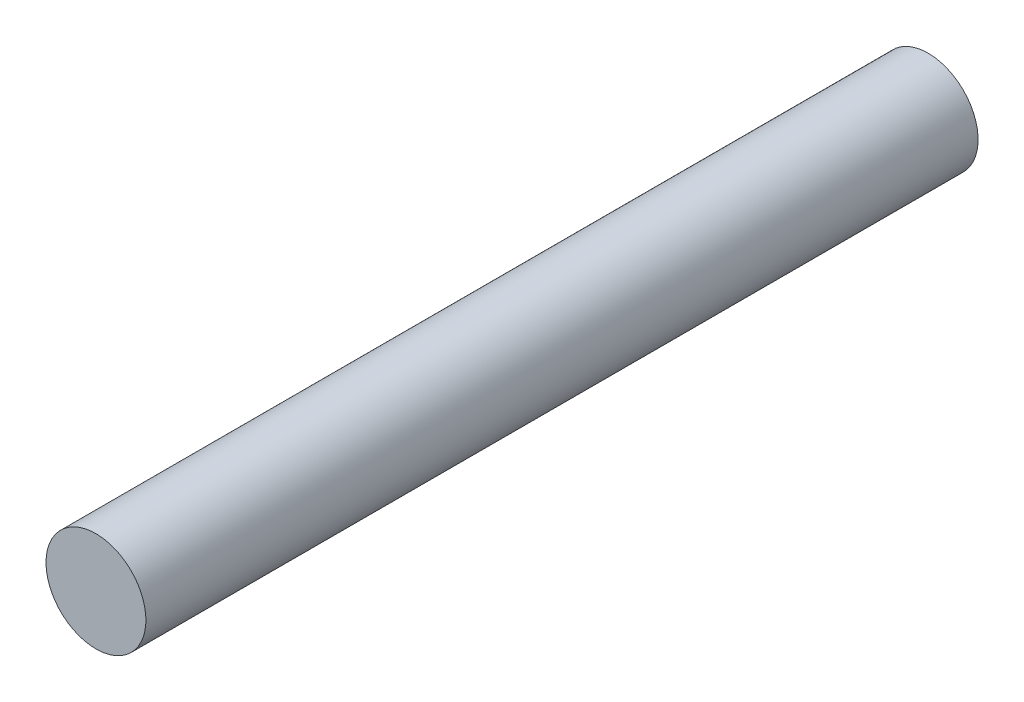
from build123d import *

# Parameters (mm, degrees)
ESQUISSE1_R      = 3
EXTRUSION1_DEPTH = 50


with BuildPart() as part:
    # Esquisse1 → Extrusion1 (new body)
    with BuildSketch(Plane.XY):
        Circle(ESQUISSE1_R)
    extrude(amount=EXTRUSION1_DEPTH)


solid = part.part
